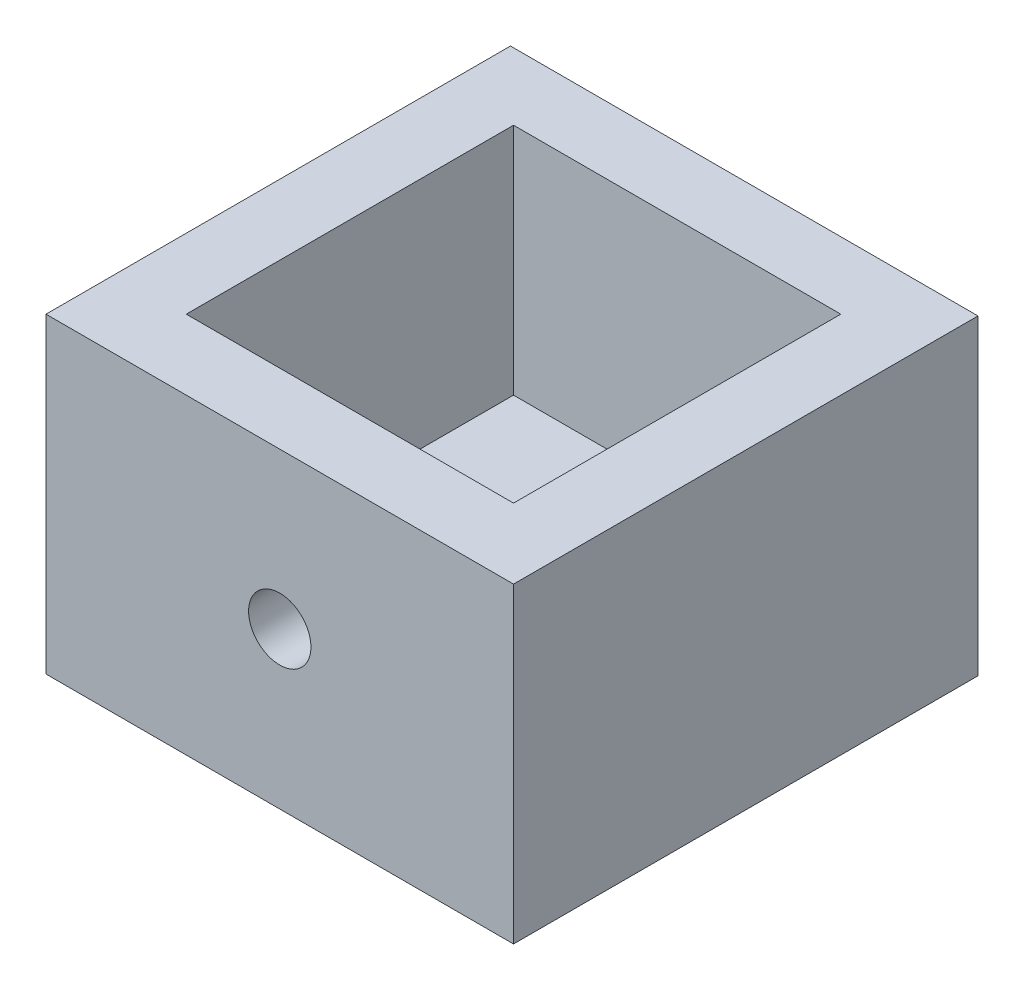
from build123d import *

# Parameters (mm, degrees)
SKETCH1_W           = 83.82
SKETCH1_H           = 25.4
BOSS_EXTRUDE1_DEPTH = 15
SKETCH4_W           = 38.1
SKETCH4_H           = 25.4
BOSS_EXTRUDE2_DEPTH = 38.1
SKETCH5_W           = 26.67
SKETCH5_H           = 26.67
CUT_EXTRUDE1_DEPTH  = 19.05
SKETCH7_R           = 3.429
CUT_EXTRUDE2_DEPTH  = 71.277739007
BOSS_EXTRUDE3_DEPTH = 83.82
SKETCH10_W          = 7
SKETCH10_H          = 4
CUT_EXTRUDE3_DEPTH  = 101.033456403
CUT_EXTRUDE4_DEPTH  = 6
SKETCH13_R          = 2.54
CUT_EXTRUDE5_DEPTH  = 10
SKETCH14_W          = 83.82
SKETCH14_H          = 20.207
CUT_EXTRUDE6_DEPTH  = 50
SKETCH15_W          = 38.1
SKETCH15_H          = 0.25
CUT_EXTRUDE7_DEPTH  = 50


with BuildPart() as part:
    # Sketch1 → Boss-Extrude1 (new body)
    with BuildSketch(Plane.XY):
        Rectangle(SKETCH1_W, SKETCH1_H)
    extrude(amount=BOSS_EXTRUDE1_DEPTH)

    # Sketch4 → Boss-Extrude2 (add)
    with BuildSketch(Plane.XY.offset(15)):
        Rectangle(SKETCH4_W, SKETCH4_H)
    extrude(amount=BOSS_EXTRUDE2_DEPTH)

    # Sketch5 → Cut-Extrude1 (cut)
    with BuildSketch(Plane(origin=(0, 12.7, 0), x_dir=(1, 0, 0), z_dir=(0, 1, 0))):
        with Locations((0, -34.05)):
            Rectangle(SKETCH5_W, SKETCH5_H)
    extrude(amount=-CUT_EXTRUDE1_DEPTH, mode=Mode.SUBTRACT)

    # Sketch7 → Cut-Extrude2 (cut, through all)
    with BuildSketch(Plane(origin=(0, -6.35, 0), x_dir=(1, 0, 0), z_dir=(0, 1, 0))):
        with Locations(Location((0, -34.05, 0), (0, 0, 270))):
            Circle(SKETCH7_R)
    extrude(amount=-CUT_EXTRUDE2_DEPTH, mode=Mode.SUBTRACT)

    # Sketch8 → Boss-Extrude3 (add)
    with BuildSketch(Plane.ZY.offset(41.91)):
        with BuildLine():
            Line((-5.207, 1.387924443), (-5.207, -1.387924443))
            ThreePointArc((-5.207, -1.387924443), (-4.980177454, -2.437119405), (-4.340220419, -3.298927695))
            Line((-4.340220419, -3.298927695), (-2.667, -4.763952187))
            Line((-2.667, -4.763952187), (-2.667, -2.54))
            Line((-2.667, -2.54), (0, -2.54))
            Line((0, -2.54), (0, 2.54))
            Line((0, 2.54), (-2.667, 2.54))
            Line((-2.667, 2.54), (-2.667, 4.763952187))
            Line((-2.667, 4.763952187), (-4.340220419, 3.298927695))
            ThreePointArc((-4.340220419, 3.298927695), (-4.980177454, 2.437119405), (-5.207, 1.387924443))
        make_face()
    extrude(amount=-BOSS_EXTRUDE3_DEPTH)

    # Sketch10 → Cut-Extrude3 (cut, through all)
    with BuildSketch(Plane(origin=(41.91, 0, 0), x_dir=(0, 0, -1), z_dir=(1, 0, 0))):
        with Locations((-11.5, 5.62)):
            Rectangle(SKETCH10_W, SKETCH10_H)
    extrude(amount=-CUT_EXTRUDE3_DEPTH, mode=Mode.SUBTRACT)

    # Sketch3 → Cut-Extrude4 (cut)
    with BuildSketch(Plane.XY.offset(15)):
        with BuildLine():
            Line((41.91, -6.859999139), (41.91, -7.619999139))
            Line((41.91, -7.619999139), (22.86, -7.619999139))
            Line((22.86, -7.619999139), (22.86, -7.37263485))
            Line((22.86, -7.37263485), (22.865217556, -6.1))
            ThreePointArc((22.865217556, -6.1), (23.242134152, -6.253372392), (23.413114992, -6.62263485))
            Line((23.413114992, -6.62263485), (23.415, -6.62263485))
            Line((23.415, -6.62263485), (23.415, -6.71))
            ThreePointArc((23.415, -6.71), (23.458933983, -6.816066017), (23.565, -6.86))
            Line((23.565, -6.86), (24.156207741, -6.860000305))
            ThreePointArc((24.156207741, -6.860000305), (24.26633366, -6.811844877), (24.305750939, -6.698297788))
            Line((24.305750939, -6.698297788), (24.304060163, -6.655895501))
            Line((24.304060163, -6.655895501), (24.304059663, -6.653448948))
            ThreePointArc((24.304059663, -6.653448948), (24.467162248, -6.262007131), (24.859058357, -6.099999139))
            Line((24.859058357, -6.099999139), (24.865217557, -6.099999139))
            ThreePointArc((24.865217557, -6.099999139), (25.242155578, -6.253318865), (25.413188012, -6.622557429))
            Line((25.413188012, -6.622557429), (25.415075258, -6.622557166))
            Line((25.415075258, -6.622557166), (25.415081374, -6.710100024))
            ThreePointArc((25.415081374, -6.710100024), (25.459022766, -6.816162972), (25.565091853, -6.860089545))
            Line((25.565091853, -6.860089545), (26.156298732, -6.860048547))
            ThreePointArc((26.156298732, -6.860048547), (26.266421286, -6.811885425), (26.305830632, -6.698335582))
            ThreePointArc((26.305830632, -6.698335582), (26.304579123, -6.677170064), (26.30413696, -6.655972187))
            Line((26.30413696, -6.655972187), (26.30413698, -6.653525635))
            ThreePointArc((26.30413698, -6.653525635), (26.467212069, -6.262034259), (26.859135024, -6.099999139))
            Line((26.859135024, -6.099999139), (26.865445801, -6.099999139))
            ThreePointArc((26.865445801, -6.099999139), (27.242216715, -6.253447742), (27.413114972, -6.622631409))
            Line((27.413114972, -6.622631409), (27.415, -6.622631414))
            Line((27.415, -6.622631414), (27.415, -6.71))
            ThreePointArc((27.415, -6.71), (27.458933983, -6.816066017), (27.565, -6.86))
            Line((27.565, -6.86), (28.156206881, -6.860000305))
            ThreePointArc((28.156206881, -6.860000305), (28.266332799, -6.811844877), (28.305750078, -6.698297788))
            ThreePointArc((28.305750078, -6.698297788), (28.304499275, -6.67711281), (28.304059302, -6.655895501))
            Line((28.304059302, -6.655895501), (28.304059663, -6.653448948))
            ThreePointArc((28.304059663, -6.653448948), (28.467161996, -6.262007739), (28.859057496, -6.1))
            Line((28.859057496, -6.1), (28.865217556, -6.1))
            ThreePointArc((28.865217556, -6.1), (29.242134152, -6.253372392), (29.413114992, -6.62263485))
            Line((29.413114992, -6.62263485), (29.415, -6.62263485))
            Line((29.415, -6.62263485), (29.415, -6.71))
            ThreePointArc((29.415, -6.71), (29.458933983, -6.816066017), (29.565, -6.86))
            Line((29.565, -6.86), (30.156206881, -6.860000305))
            ThreePointArc((30.156206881, -6.860000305), (30.266332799, -6.811844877), (30.305750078, -6.698297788))
            ThreePointArc((30.305750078, -6.698297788), (30.304499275, -6.67711281), (30.304059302, -6.655895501))
            Line((30.304059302, -6.655895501), (30.304059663, -6.653448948))
            ThreePointArc((30.304059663, -6.653448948), (30.467161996, -6.262007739), (30.859057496, -6.1))
            Line((30.859057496, -6.1), (30.865217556, -6.1))
            ThreePointArc((30.865217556, -6.1), (31.242134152, -6.253372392), (31.413114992, -6.62263485))
            Line((31.413114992, -6.62263485), (31.415, -6.62263485))
            Line((31.415, -6.62263485), (31.415, -6.71))
            ThreePointArc((31.415, -6.71), (31.458933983, -6.816066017), (31.565, -6.86))
            Line((31.565, -6.86), (32.156206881, -6.860000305))
            ThreePointArc((32.156206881, -6.860000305), (32.266332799, -6.811844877), (32.305750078, -6.698297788))
            ThreePointArc((32.305750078, -6.698297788), (32.304499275, -6.67711281), (32.304059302, -6.655895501))
            Line((32.304059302, -6.655895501), (32.304059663, -6.653448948))
            ThreePointArc((32.304059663, -6.653448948), (32.467161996, -6.262007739), (32.859057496, -6.1))
            Line((32.859057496, -6.1), (32.865217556, -6.1))
            ThreePointArc((32.865217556, -6.1), (33.242134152, -6.253372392), (33.413114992, -6.62263485))
            Line((33.413114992, -6.62263485), (33.415, -6.62263485))
            Line((33.415, -6.62263485), (33.415, -6.71))
            ThreePointArc((33.415, -6.71), (33.458933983, -6.816066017), (33.565, -6.86))
            Line((33.565, -6.86), (34.156206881, -6.860000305))
            ThreePointArc((34.156206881, -6.860000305), (34.266332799, -6.811844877), (34.305750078, -6.698297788))
            ThreePointArc((34.305750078, -6.698297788), (34.304499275, -6.67711281), (34.304059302, -6.655895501))
            Line((34.304059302, -6.655895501), (34.304059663, -6.653448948))
            ThreePointArc((34.304059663, -6.653448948), (34.467161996, -6.262007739), (34.859057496, -6.1))
            Line((34.859057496, -6.1), (34.865217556, -6.1))
            ThreePointArc((34.865217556, -6.1), (35.242134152, -6.253372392), (35.413114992, -6.62263485))
            Line((35.413114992, -6.62263485), (35.415, -6.62263485))
            Line((35.415, -6.62263485), (35.415, -6.71))
            ThreePointArc((35.415, -6.71), (35.458933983, -6.816066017), (35.565, -6.86))
            Line((35.565, -6.86), (36.156206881, -6.860000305))
            ThreePointArc((36.156206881, -6.860000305), (36.266332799, -6.811844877), (36.305750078, -6.698297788))
            ThreePointArc((36.305750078, -6.698297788), (36.304499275, -6.67711281), (36.304059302, -6.655895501))
            Line((36.304059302, -6.655895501), (36.304059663, -6.653448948))
            ThreePointArc((36.304059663, -6.653448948), (36.467161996, -6.262007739), (36.859057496, -6.1))
            Line((36.859057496, -6.1), (36.865218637, -6.1))
            ThreePointArc((36.865218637, -6.1), (37.242151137, -6.253364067), (37.413140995, -6.622635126))
            Line((37.413140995, -6.622635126), (37.415026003, -6.622635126))
            Line((37.415026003, -6.622635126), (37.415026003, -6.710000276))
            ThreePointArc((37.415026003, -6.710000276), (37.458959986, -6.816066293), (37.565026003, -6.860000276))
            Line((37.565026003, -6.860000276), (38.156207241, -6.860000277))
            ThreePointArc((38.156207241, -6.860000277), (38.266333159, -6.811844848), (38.305750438, -6.69829776))
            ThreePointArc((38.305750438, -6.69829776), (38.304499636, -6.677112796), (38.304059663, -6.6558955))
            Line((38.304059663, -6.6558955), (38.304059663, -6.653448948))
            ThreePointArc((38.304059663, -6.653448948), (38.467161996, -6.262007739), (38.859057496, -6.1))
            Line((38.859057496, -6.1), (38.865193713, -6.1))
            ThreePointArc((38.865193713, -6.1), (39.242126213, -6.253364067), (39.413116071, -6.622635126))
            Line((39.413116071, -6.622635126), (39.415001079, -6.622635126))
            Line((39.415001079, -6.622635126), (39.415001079, -6.710000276))
            ThreePointArc((39.415001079, -6.710000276), (39.458935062, -6.816066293), (39.565001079, -6.860000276))
            Line((39.565001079, -6.860000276), (40.156207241, -6.859999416))
            ThreePointArc((40.156207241, -6.859999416), (40.266333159, -6.811843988), (40.305750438, -6.698296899))
            ThreePointArc((40.305750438, -6.698296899), (40.304499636, -6.677111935), (40.304059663, -6.65589464))
            Line((40.304059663, -6.65589464), (40.304059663, -6.653448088))
            ThreePointArc((40.304059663, -6.653448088), (40.467161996, -6.262006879), (40.859057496, -6.099999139))
            Line((40.859057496, -6.099999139), (40.865217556, -6.099999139))
            ThreePointArc((40.865217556, -6.099999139), (41.242134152, -6.253371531), (41.413114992, -6.622633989))
            Line((41.413114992, -6.622633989), (41.415, -6.622633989))
            Line((41.415, -6.622633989), (41.415, -6.709999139))
            ThreePointArc((41.415, -6.709999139), (41.458933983, -6.816065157), (41.565, -6.859999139))
            Line((41.565, -6.859999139), (41.91, -6.859999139))
        make_face()
        with BuildLine():
            Line((-41.91, -6.859999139), (-41.91, -7.619999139))
            Line((-41.91, -7.619999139), (-22.86, -7.619999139))
            Line((-22.86, -7.619999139), (-22.86, -7.37263485))
            Line((-22.86, -7.37263485), (-22.865217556, -6.1))
            ThreePointArc((-22.865217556, -6.1), (-23.242134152, -6.253372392), (-23.413114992, -6.62263485))
            Line((-23.413114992, -6.62263485), (-23.415, -6.62263485))
            Line((-23.415, -6.62263485), (-23.415, -6.71))
            ThreePointArc((-23.415, -6.71), (-23.458933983, -6.816066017), (-23.565, -6.86))
            Line((-23.565, -6.86), (-24.156207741, -6.860000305))
            ThreePointArc((-24.156207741, -6.860000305), (-24.26633366, -6.811844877), (-24.305750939, -6.698297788))
            ThreePointArc((-24.305750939, -6.698297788), (-24.304480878, -6.676624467), (-24.304059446, -6.654918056))
            Line((-24.304059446, -6.654918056), (-24.304059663, -6.653448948))
            ThreePointArc((-24.304059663, -6.653448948), (-24.467162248, -6.262007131), (-24.859058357, -6.099999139))
            Line((-24.859058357, -6.099999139), (-24.865217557, -6.099999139))
            ThreePointArc((-24.865217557, -6.099999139), (-25.242155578, -6.253318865), (-25.413188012, -6.622557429))
            Line((-25.413188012, -6.622557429), (-25.415075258, -6.622557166))
            Line((-25.415075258, -6.622557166), (-25.415081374, -6.710100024))
            ThreePointArc((-25.415081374, -6.710100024), (-25.459022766, -6.816162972), (-25.565091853, -6.860089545))
            Line((-25.565091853, -6.860089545), (-26.156298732, -6.860048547))
            ThreePointArc((-26.156298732, -6.860048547), (-26.266421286, -6.811885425), (-26.305830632, -6.698335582))
            ThreePointArc((-26.305830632, -6.698335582), (-26.304579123, -6.677170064), (-26.30413696, -6.655972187))
            Line((-26.30413696, -6.655972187), (-26.30413698, -6.653525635))
            ThreePointArc((-26.30413698, -6.653525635), (-26.467212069, -6.262034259), (-26.859135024, -6.099999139))
            Line((-26.859135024, -6.099999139), (-26.865445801, -6.099999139))
            ThreePointArc((-26.865445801, -6.099999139), (-27.242216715, -6.253447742), (-27.413114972, -6.622631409))
            Line((-27.413114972, -6.622631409), (-27.415, -6.622631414))
            Line((-27.415, -6.622631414), (-27.415, -6.71))
            ThreePointArc((-27.415, -6.71), (-27.458933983, -6.816066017), (-27.565, -6.86))
            Line((-27.565, -6.86), (-28.156206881, -6.860000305))
            ThreePointArc((-28.156206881, -6.860000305), (-28.266332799, -6.811844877), (-28.305750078, -6.698297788))
            ThreePointArc((-28.305750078, -6.698297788), (-28.304499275, -6.67711281), (-28.304059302, -6.655895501))
            Line((-28.304059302, -6.655895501), (-28.304059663, -6.653448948))
            ThreePointArc((-28.304059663, -6.653448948), (-28.467161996, -6.262007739), (-28.859057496, -6.1))
            Line((-28.859057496, -6.1), (-28.865217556, -6.1))
            ThreePointArc((-28.865217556, -6.1), (-29.242134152, -6.253372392), (-29.413114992, -6.62263485))
            Line((-29.413114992, -6.62263485), (-29.415, -6.62263485))
            Line((-29.415, -6.62263485), (-29.415, -6.71))
            ThreePointArc((-29.415, -6.71), (-29.458933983, -6.816066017), (-29.565, -6.86))
            Line((-29.565, -6.86), (-30.156206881, -6.860000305))
            ThreePointArc((-30.156206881, -6.860000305), (-30.266332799, -6.811844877), (-30.305750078, -6.698297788))
            ThreePointArc((-30.305750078, -6.698297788), (-30.304499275, -6.67711281), (-30.304059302, -6.655895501))
            Line((-30.304059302, -6.655895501), (-30.304059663, -6.653448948))
            ThreePointArc((-30.304059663, -6.653448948), (-30.467161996, -6.262007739), (-30.859057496, -6.1))
            Line((-30.859057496, -6.1), (-30.865217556, -6.1))
            ThreePointArc((-30.865217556, -6.1), (-31.242134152, -6.253372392), (-31.413114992, -6.62263485))
            Line((-31.413114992, -6.62263485), (-31.415, -6.62263485))
            Line((-31.415, -6.62263485), (-31.415, -6.71))
            ThreePointArc((-31.415, -6.71), (-31.458933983, -6.816066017), (-31.565, -6.86))
            Line((-31.565, -6.86), (-32.156206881, -6.860000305))
            ThreePointArc((-32.156206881, -6.860000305), (-32.266332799, -6.811844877), (-32.305750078, -6.698297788))
            ThreePointArc((-32.305750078, -6.698297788), (-32.304499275, -6.67711281), (-32.304059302, -6.655895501))
            Line((-32.304059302, -6.655895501), (-32.304059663, -6.653448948))
            ThreePointArc((-32.304059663, -6.653448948), (-32.467161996, -6.262007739), (-32.859057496, -6.1))
            Line((-32.859057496, -6.1), (-32.865217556, -6.1))
            ThreePointArc((-32.865217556, -6.1), (-33.242134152, -6.253372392), (-33.413114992, -6.62263485))
            Line((-33.413114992, -6.62263485), (-33.415, -6.62263485))
            Line((-33.415, -6.62263485), (-33.415, -6.71))
            ThreePointArc((-33.415, -6.71), (-33.458933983, -6.816066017), (-33.565, -6.86))
            Line((-33.565, -6.86), (-34.156206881, -6.860000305))
            ThreePointArc((-34.156206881, -6.860000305), (-34.266332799, -6.811844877), (-34.305750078, -6.698297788))
            ThreePointArc((-34.305750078, -6.698297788), (-34.304499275, -6.67711281), (-34.304059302, -6.655895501))
            Line((-34.304059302, -6.655895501), (-34.304059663, -6.653448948))
            ThreePointArc((-34.304059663, -6.653448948), (-34.467161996, -6.262007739), (-34.859057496, -6.1))
            Line((-34.859057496, -6.1), (-34.865217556, -6.1))
            ThreePointArc((-34.865217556, -6.1), (-35.242134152, -6.253372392), (-35.413114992, -6.62263485))
            Line((-35.413114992, -6.62263485), (-35.415, -6.62263485))
            Line((-35.415, -6.62263485), (-35.415, -6.71))
            ThreePointArc((-35.415, -6.71), (-35.458933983, -6.816066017), (-35.565, -6.86))
            Line((-35.565, -6.86), (-36.156206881, -6.860000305))
            ThreePointArc((-36.156206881, -6.860000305), (-36.266332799, -6.811844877), (-36.305750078, -6.698297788))
            ThreePointArc((-36.305750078, -6.698297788), (-36.304499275, -6.67711281), (-36.304059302, -6.655895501))
            Line((-36.304059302, -6.655895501), (-36.304059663, -6.653448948))
            ThreePointArc((-36.304059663, -6.653448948), (-36.467161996, -6.262007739), (-36.859057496, -6.1))
            Line((-36.859057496, -6.1), (-36.865218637, -6.1))
            ThreePointArc((-36.865218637, -6.1), (-37.242151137, -6.253364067), (-37.413140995, -6.622635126))
            Line((-37.413140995, -6.622635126), (-37.415026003, -6.710000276))
            ThreePointArc((-37.415026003, -6.710000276), (-37.458959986, -6.816066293), (-37.565026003, -6.860000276))
            Line((-37.565026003, -6.860000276), (-38.156207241, -6.860000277))
            ThreePointArc((-38.156207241, -6.860000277), (-38.266333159, -6.811844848), (-38.305750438, -6.69829776))
            Line((-38.305750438, -6.69829776), (-38.304059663, -6.653448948))
            ThreePointArc((-38.304059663, -6.653448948), (-38.467161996, -6.262007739), (-38.859057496, -6.1))
            Line((-38.859057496, -6.1), (-38.865193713, -6.1))
            ThreePointArc((-38.865193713, -6.1), (-39.242126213, -6.253364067), (-39.413116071, -6.622635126))
            Line((-39.413116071, -6.622635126), (-39.415001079, -6.710000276))
            ThreePointArc((-39.415001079, -6.710000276), (-39.458935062, -6.816066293), (-39.565001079, -6.860000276))
            Line((-39.565001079, -6.860000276), (-40.156207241, -6.859999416))
            ThreePointArc((-40.156207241, -6.859999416), (-40.266333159, -6.811843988), (-40.305750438, -6.698296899))
            Line((-40.305750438, -6.698296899), (-40.304059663, -6.653448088))
            ThreePointArc((-40.304059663, -6.653448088), (-40.467161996, -6.262006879), (-40.859057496, -6.099999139))
            Line((-40.859057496, -6.099999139), (-40.865217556, -6.099999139))
            ThreePointArc((-40.865217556, -6.099999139), (-41.242134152, -6.253371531), (-41.413114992, -6.622633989))
            Line((-41.413114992, -6.622633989), (-41.415, -6.709999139))
            ThreePointArc((-41.415, -6.709999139), (-41.458933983, -6.816065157), (-41.565, -6.859999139))
            Line((-41.565, -6.859999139), (-41.91, -6.859999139))
        make_face()
    extrude(amount=-CUT_EXTRUDE4_DEPTH, mode=Mode.SUBTRACT)

    # Sketch13 → Cut-Extrude5 (cut)
    with BuildSketch(Plane.XY.offset(53.1)):
        Circle(SKETCH13_R)
    extrude(amount=-CUT_EXTRUDE5_DEPTH, mode=Mode.SUBTRACT)

    # Sketch14 → Cut-Extrude6 (cut)
    with BuildSketch(Plane(origin=(0, 12.7, 0), x_dir=(1, 0, 0), z_dir=(0, 1, 0))):
        with Locations((0, -4.8965)):
            Rectangle(SKETCH14_W, SKETCH14_H)
    extrude(amount=-CUT_EXTRUDE6_DEPTH, mode=Mode.SUBTRACT)

    # Sketch15 → Cut-Extrude7 (cut)
    with BuildSketch(Plane.XZ.offset(12.7)):
        with Locations((0, 15.125)):
            Rectangle(SKETCH15_W, SKETCH15_H)
    extrude(amount=-CUT_EXTRUDE7_DEPTH, mode=Mode.SUBTRACT)


solid = part.part
